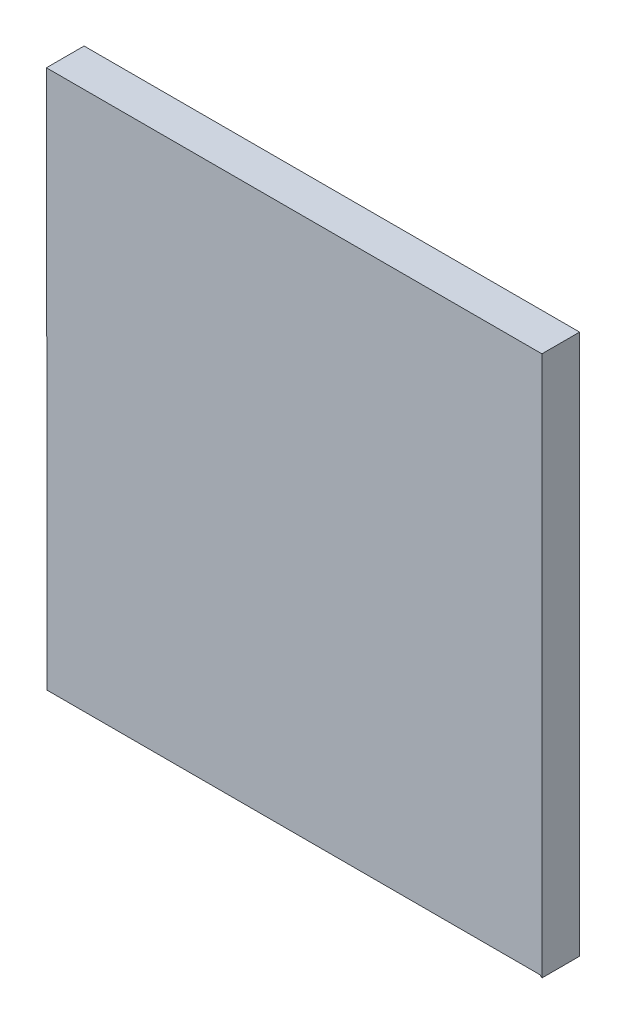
ISO-10303-21;
HEADER;
FILE_DESCRIPTION(('STEP AP214'),'2;1');
FILE_NAME('part.step','',(''),(''),'','','');
FILE_SCHEMA(('AUTOMOTIVE_DESIGN { 1 0 10303 214 1 1 1 1 }'));
ENDSEC;
DATA;
#1=APPLICATION_CONTEXT('core data for automotive mechanical design processes');
#2=APPLICATION_PROTOCOL_DEFINITION('international standard','automotive_design',2000,#1);
#3=PRODUCT_CONTEXT('',#1,'mechanical');
#4=PRODUCT('Part','Part','',(#3));
#5=PRODUCT_RELATED_PRODUCT_CATEGORY('part','',(#4));
#6=PRODUCT_DEFINITION_FORMATION('','',#4);
#7=PRODUCT_DEFINITION_CONTEXT('part definition',#1,'design');
#8=PRODUCT_DEFINITION('design','',#6,#7);
#9=PRODUCT_DEFINITION_SHAPE('','',#8);
#10=(LENGTH_UNIT() NAMED_UNIT(*) SI_UNIT(.MILLI.,.METRE.));
#11=(NAMED_UNIT(*) PLANE_ANGLE_UNIT() SI_UNIT($,.RADIAN.));
#12=(NAMED_UNIT(*) SI_UNIT($,.STERADIAN.) SOLID_ANGLE_UNIT());
#13=UNCERTAINTY_MEASURE_WITH_UNIT(LENGTH_MEASURE(1.E-05),#10,'distance_accuracy_value','');
#14=(GEOMETRIC_REPRESENTATION_CONTEXT(3) GLOBAL_UNCERTAINTY_ASSIGNED_CONTEXT((#13)) GLOBAL_UNIT_ASSIGNED_CONTEXT((#10,
#11,#12)) REPRESENTATION_CONTEXT('',''));
#15=CARTESIAN_POINT('',(0.,0.,0.));
#16=DIRECTION('',(0.,0.,1.));
#17=DIRECTION('',(1.,0.,0.));
#18=AXIS2_PLACEMENT_3D('',#15,#16,#17);
#19=CARTESIAN_POINT('',(0.01151065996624,0.01545777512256,0.85000084));
#20=DIRECTION('',(0.,0.,1.));
#21=DIRECTION('',(1.,0.,0.));
#22=AXIS2_PLACEMENT_3D('',#19,#20,#21);
#23=PLANE('',#22);
#24=DIRECTION('',(1.,0.,0.));
#25=VECTOR('',#24,1.);
#26=CARTESIAN_POINT('',(-5.5701184,-6.05430336,0.85000084));
#27=LINE('',#26,#25);
#28=CARTESIAN_POINT('',(-5.5701184,-6.05430336,0.85000084));
#29=VERTEX_POINT('',#28);
#30=CARTESIAN_POINT('',(5.54630336,-6.05430336,0.85000084));
#31=VERTEX_POINT('',#30);
#32=EDGE_CURVE('E84',#29,#31,#27,.T.);
#33=ORIENTED_EDGE('',*,*,#32,.T.);
#34=DIRECTION('',(0.707106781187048,-0.707106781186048,0.));
#35=VECTOR('',#34,1.);
#36=CARTESIAN_POINT('',(5.54630336,-6.05430336,0.85000084));
#37=LINE('',#36,#35);
#38=CARTESIAN_POINT('',(5.588,-6.096,0.85000084));
#39=VERTEX_POINT('',#38);
#40=EDGE_CURVE('E81',#31,#39,#37,.T.);
#41=ORIENTED_EDGE('',*,*,#40,.T.);
#42=DIRECTION('',(0.,1.,0.));
#43=VECTOR('',#42,1.);
#44=CARTESIAN_POINT('',(5.588,-6.096,0.85000084));
#45=LINE('',#44,#43);
#46=CARTESIAN_POINT('',(5.588,6.096,0.85000084));
#47=VERTEX_POINT('',#46);
#48=EDGE_CURVE('E68',#39,#47,#45,.T.);
#49=ORIENTED_EDGE('',*,*,#48,.T.);
#50=DIRECTION('',(-1.,0.,0.));
#51=VECTOR('',#50,1.);
#52=CARTESIAN_POINT('',(5.588,6.096,0.85000084));
#53=LINE('',#52,#51);
#54=CARTESIAN_POINT('',(-5.588,6.096,0.85000084));
#55=VERTEX_POINT('',#54);
#56=EDGE_CURVE('E108',#47,#55,#53,.T.);
#57=ORIENTED_EDGE('',*,*,#56,.T.);
#58=DIRECTION('',(0.00147169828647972,-0.99999891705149,0.));
#59=VECTOR('',#58,1.);
#60=CARTESIAN_POINT('',(-5.588,6.096,0.85000084));
#61=LINE('',#60,#59);
#62=EDGE_CURVE('E11',#55,#29,#61,.T.);
#63=ORIENTED_EDGE('',*,*,#62,.T.);
#64=EDGE_LOOP('',(#33,#41,#49,#57,#63));
#65=FACE_BOUND('',#64,.T.);
#66=ADVANCED_FACE('F17',(#65),#23,.T.);
#67=CARTESIAN_POINT('',(0.01151065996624,0.01545777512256,0.));
#68=DIRECTION('',(0.,0.,1.));
#69=DIRECTION('',(1.,0.,0.));
#70=AXIS2_PLACEMENT_3D('',#67,#68,#69);
#71=PLANE('',#70);
#72=DIRECTION('',(0.00147169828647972,-0.99999891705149,0.));
#73=VECTOR('',#72,1.);
#74=CARTESIAN_POINT('',(-5.588,6.096,0.));
#75=LINE('',#74,#73);
#76=CARTESIAN_POINT('',(-5.588,6.096,0.));
#77=VERTEX_POINT('',#76);
#78=CARTESIAN_POINT('',(-5.5701184,-6.05430336,0.));
#79=VERTEX_POINT('',#78);
#80=EDGE_CURVE('E26',#77,#79,#75,.T.);
#81=ORIENTED_EDGE('',*,*,#80,.F.);
#82=DIRECTION('',(-1.,0.,0.));
#83=VECTOR('',#82,1.);
#84=CARTESIAN_POINT('',(5.588,6.096,0.));
#85=LINE('',#84,#83);
#86=CARTESIAN_POINT('',(5.588,6.096,0.));
#87=VERTEX_POINT('',#86);
#88=EDGE_CURVE('E56',#87,#77,#85,.T.);
#89=ORIENTED_EDGE('',*,*,#88,.F.);
#90=DIRECTION('',(0.,1.,0.));
#91=VECTOR('',#90,1.);
#92=CARTESIAN_POINT('',(5.588,-6.096,0.));
#93=LINE('',#92,#91);
#94=CARTESIAN_POINT('',(5.588,-6.096,0.));
#95=VERTEX_POINT('',#94);
#96=EDGE_CURVE('E89',#95,#87,#93,.T.);
#97=ORIENTED_EDGE('',*,*,#96,.F.);
#98=DIRECTION('',(0.707106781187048,-0.707106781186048,0.));
#99=VECTOR('',#98,1.);
#100=CARTESIAN_POINT('',(5.54630336,-6.05430336,0.));
#101=LINE('',#100,#99);
#102=CARTESIAN_POINT('',(5.54630336,-6.05430336,0.));
#103=VERTEX_POINT('',#102);
#104=EDGE_CURVE('E93',#103,#95,#101,.T.);
#105=ORIENTED_EDGE('',*,*,#104,.F.);
#106=DIRECTION('',(1.,0.,0.));
#107=VECTOR('',#106,1.);
#108=CARTESIAN_POINT('',(-5.5701184,-6.05430336,0.));
#109=LINE('',#108,#107);
#110=EDGE_CURVE('E128',#79,#103,#109,.T.);
#111=ORIENTED_EDGE('',*,*,#110,.F.);
#112=EDGE_LOOP('',(#81,#89,#97,#105,#111));
#113=FACE_BOUND('',#112,.T.);
#114=ADVANCED_FACE('F131',(#113),#71,.F.);
#115=CARTESIAN_POINT('',(-5.588,6.096,0.));
#116=DIRECTION('',(0.99999891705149,0.00147169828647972,0.));
#117=DIRECTION('',(0.,0.,-1.));
#118=AXIS2_PLACEMENT_3D('',#115,#116,#117);
#119=PLANE('',#118);
#120=ORIENTED_EDGE('',*,*,#80,.T.);
#121=DIRECTION('',(0.,0.,1.));
#122=VECTOR('',#121,1.);
#123=CARTESIAN_POINT('',(-5.5701184,-6.05430336,0.));
#124=LINE('',#123,#122);
#125=EDGE_CURVE('E100',#79,#29,#124,.T.);
#126=ORIENTED_EDGE('',*,*,#125,.T.);
#127=ORIENTED_EDGE('',*,*,#62,.F.);
#128=DIRECTION('',(0.,0.,1.));
#129=VECTOR('',#128,1.);
#130=CARTESIAN_POINT('',(-5.588,6.096,0.));
#131=LINE('',#130,#129);
#132=EDGE_CURVE('E110',#77,#55,#131,.T.);
#133=ORIENTED_EDGE('',*,*,#132,.F.);
#134=EDGE_LOOP('',(#120,#126,#127,#133));
#135=FACE_BOUND('',#134,.T.);
#136=ADVANCED_FACE('F119',(#135),#119,.F.);
#137=CARTESIAN_POINT('',(5.588,6.096,0.));
#138=DIRECTION('',(0.,-1.,0.));
#139=DIRECTION('',(0.,0.,-1.));
#140=AXIS2_PLACEMENT_3D('',#137,#138,#139);
#141=PLANE('',#140);
#142=ORIENTED_EDGE('',*,*,#88,.T.);
#143=ORIENTED_EDGE('',*,*,#132,.T.);
#144=ORIENTED_EDGE('',*,*,#56,.F.);
#145=DIRECTION('',(0.,0.,1.));
#146=VECTOR('',#145,1.);
#147=CARTESIAN_POINT('',(5.588,6.096,0.));
#148=LINE('',#147,#146);
#149=EDGE_CURVE('E75',#87,#47,#148,.T.);
#150=ORIENTED_EDGE('',*,*,#149,.F.);
#151=EDGE_LOOP('',(#142,#143,#144,#150));
#152=FACE_BOUND('',#151,.T.);
#153=ADVANCED_FACE('F144',(#152),#141,.F.);
#154=CARTESIAN_POINT('',(5.588,-6.096,0.));
#155=DIRECTION('',(-1.,0.,0.));
#156=DIRECTION('',(0.,0.,1.));
#157=AXIS2_PLACEMENT_3D('',#154,#155,#156);
#158=PLANE('',#157);
#159=ORIENTED_EDGE('',*,*,#96,.T.);
#160=ORIENTED_EDGE('',*,*,#149,.T.);
#161=ORIENTED_EDGE('',*,*,#48,.F.);
#162=DIRECTION('',(0.,0.,1.));
#163=VECTOR('',#162,1.);
#164=CARTESIAN_POINT('',(5.588,-6.096,0.));
#165=LINE('',#164,#163);
#166=EDGE_CURVE('E73',#95,#39,#165,.T.);
#167=ORIENTED_EDGE('',*,*,#166,.F.);
#168=EDGE_LOOP('',(#159,#160,#161,#167));
#169=FACE_BOUND('',#168,.T.);
#170=ADVANCED_FACE('F71',(#169),#158,.F.);
#171=CARTESIAN_POINT('',(5.54630336,-6.05430336,0.));
#172=DIRECTION('',(0.707106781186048,0.707106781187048,0.));
#173=DIRECTION('',(0.,0.,-1.));
#174=AXIS2_PLACEMENT_3D('',#171,#172,#173);
#175=PLANE('',#174);
#176=ORIENTED_EDGE('',*,*,#104,.T.);
#177=ORIENTED_EDGE('',*,*,#166,.T.);
#178=ORIENTED_EDGE('',*,*,#40,.F.);
#179=DIRECTION('',(0.,0.,1.));
#180=VECTOR('',#179,1.);
#181=CARTESIAN_POINT('',(5.54630336,-6.05430336,0.));
#182=LINE('',#181,#180);
#183=EDGE_CURVE('E133',#103,#31,#182,.T.);
#184=ORIENTED_EDGE('',*,*,#183,.F.);
#185=EDGE_LOOP('',(#176,#177,#178,#184));
#186=FACE_BOUND('',#185,.T.);
#187=ADVANCED_FACE('F91',(#186),#175,.F.);
#188=CARTESIAN_POINT('',(-5.5701184,-6.05430336,0.));
#189=DIRECTION('',(0.,1.,0.));
#190=DIRECTION('',(1.,0.,0.));
#191=AXIS2_PLACEMENT_3D('',#188,#189,#190);
#192=PLANE('',#191);
#193=ORIENTED_EDGE('',*,*,#110,.T.);
#194=ORIENTED_EDGE('',*,*,#183,.T.);
#195=ORIENTED_EDGE('',*,*,#32,.F.);
#196=ORIENTED_EDGE('',*,*,#125,.F.);
#197=EDGE_LOOP('',(#193,#194,#195,#196));
#198=FACE_BOUND('',#197,.T.);
#199=ADVANCED_FACE('F127',(#198),#192,.F.);
#200=CLOSED_SHELL('',(#66,#114,#136,#153,#170,#187,#199));
#201=MANIFOLD_SOLID_BREP('B1',#200);
#202=ADVANCED_BREP_SHAPE_REPRESENTATION('',(#18,#201),#14);
#203=SHAPE_DEFINITION_REPRESENTATION(#9,#202);
ENDSEC;
END-ISO-10303-21;
